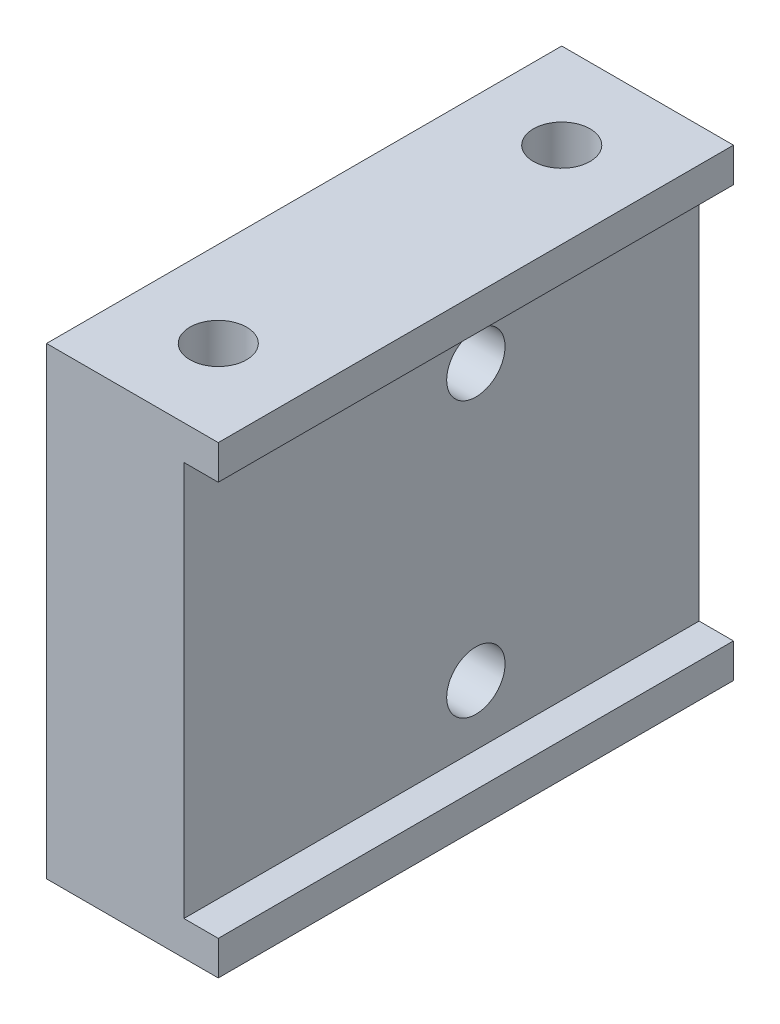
ISO-10303-21;
HEADER;
FILE_DESCRIPTION(('STEP AP214'),'2;1');
FILE_NAME('part.step','',(''),(''),'','','');
FILE_SCHEMA(('AUTOMOTIVE_DESIGN { 1 0 10303 214 1 1 1 1 }'));
ENDSEC;
DATA;
#1=APPLICATION_CONTEXT('core data for automotive mechanical design processes');
#2=APPLICATION_PROTOCOL_DEFINITION('international standard','automotive_design',2000,#1);
#3=PRODUCT_CONTEXT('',#1,'mechanical');
#4=PRODUCT('Part','Part','',(#3));
#5=PRODUCT_RELATED_PRODUCT_CATEGORY('part','',(#4));
#6=PRODUCT_DEFINITION_FORMATION('','',#4);
#7=PRODUCT_DEFINITION_CONTEXT('part definition',#1,'design');
#8=PRODUCT_DEFINITION('design','',#6,#7);
#9=PRODUCT_DEFINITION_SHAPE('','',#8);
#10=(LENGTH_UNIT() NAMED_UNIT(*) SI_UNIT(.MILLI.,.METRE.));
#11=(NAMED_UNIT(*) PLANE_ANGLE_UNIT() SI_UNIT($,.RADIAN.));
#12=(NAMED_UNIT(*) SI_UNIT($,.STERADIAN.) SOLID_ANGLE_UNIT());
#13=UNCERTAINTY_MEASURE_WITH_UNIT(LENGTH_MEASURE(1.E-05),#10,'distance_accuracy_value','');
#14=(GEOMETRIC_REPRESENTATION_CONTEXT(3) GLOBAL_UNCERTAINTY_ASSIGNED_CONTEXT((#13)) GLOBAL_UNIT_ASSIGNED_CONTEXT((#10,
#11,#12)) REPRESENTATION_CONTEXT('',''));
#15=CARTESIAN_POINT('',(0.,0.,0.));
#16=DIRECTION('',(0.,0.,1.));
#17=DIRECTION('',(1.,0.,0.));
#18=AXIS2_PLACEMENT_3D('',#15,#16,#17);
#19=CARTESIAN_POINT('',(24.3,-8.,-30.));
#20=DIRECTION('',(1.,0.,0.));
#21=DIRECTION('',(0.,1.,0.));
#22=AXIS2_PLACEMENT_3D('',#19,#20,#21);
#23=PLANE('',#22);
#24=DIRECTION('',(0.,0.,1.));
#25=VECTOR('',#24,1.);
#26=CARTESIAN_POINT('',(24.3,-33.,-30.));
#27=LINE('',#26,#25);
#28=CARTESIAN_POINT('',(24.3,-33.,-30.));
#29=VERTEX_POINT('',#28);
#30=CARTESIAN_POINT('',(24.3,-33.,0.));
#31=VERTEX_POINT('',#30);
#32=EDGE_CURVE('E151',#29,#31,#27,.T.);
#33=ORIENTED_EDGE('',*,*,#32,.T.);
#34=DIRECTION('',(0.,1.,0.));
#35=VECTOR('',#34,1.);
#36=CARTESIAN_POINT('',(24.3,-8.,0.));
#37=LINE('',#36,#35);
#38=CARTESIAN_POINT('',(24.3,-35.,0.));
#39=VERTEX_POINT('',#38);
#40=EDGE_CURVE('E177',#39,#31,#37,.T.);
#41=ORIENTED_EDGE('',*,*,#40,.F.);
#42=DIRECTION('',(0.,0.,1.));
#43=VECTOR('',#42,1.);
#44=CARTESIAN_POINT('',(24.3,-35.,-30.));
#45=LINE('',#44,#43);
#46=CARTESIAN_POINT('',(24.3,-35.,-30.));
#47=VERTEX_POINT('',#46);
#48=EDGE_CURVE('E184',#47,#39,#45,.T.);
#49=ORIENTED_EDGE('',*,*,#48,.F.);
#50=DIRECTION('',(0.,1.,0.));
#51=VECTOR('',#50,1.);
#52=CARTESIAN_POINT('',(24.3,-8.,-30.));
#53=LINE('',#52,#51);
#54=EDGE_CURVE('E166',#47,#29,#53,.T.);
#55=ORIENTED_EDGE('',*,*,#54,.T.);
#56=EDGE_LOOP('',(#33,#41,#49,#55));
#57=FACE_BOUND('',#56,.T.);
#58=ADVANCED_FACE('F16',(#57),#23,.T.);
#59=CARTESIAN_POINT('',(14.3,-8.,-30.));
#60=DIRECTION('',(-1.,0.,0.));
#61=DIRECTION('',(0.,-1.,0.));
#62=AXIS2_PLACEMENT_3D('',#59,#60,#61);
#63=PLANE('',#62);
#64=CARTESIAN_POINT('',(14.3,-13.5,-17.));
#65=DIRECTION('',(-1.,0.,0.));
#66=DIRECTION('',(0.,0.,1.));
#67=AXIS2_PLACEMENT_3D('',#64,#65,#66);
#68=CIRCLE('',#67,3.);
#69=CARTESIAN_POINT('',(14.3,-13.5,-14.));
#70=VERTEX_POINT('',#69);
#71=EDGE_CURVE('E116',#70,#70,#68,.T.);
#72=ORIENTED_EDGE('',*,*,#71,.F.);
#73=EDGE_LOOP('',(#72));
#74=FACE_BOUND('',#73,.T.);
#75=CARTESIAN_POINT('',(14.3,-29.5,-17.));
#76=DIRECTION('',(-1.,0.,0.));
#77=DIRECTION('',(0.,0.,1.));
#78=AXIS2_PLACEMENT_3D('',#75,#76,#77);
#79=CIRCLE('',#78,3.);
#80=CARTESIAN_POINT('',(14.3,-29.5,-14.));
#81=VERTEX_POINT('',#80);
#82=EDGE_CURVE('E125',#81,#81,#79,.T.);
#83=ORIENTED_EDGE('',*,*,#82,.F.);
#84=EDGE_LOOP('',(#83));
#85=FACE_BOUND('',#84,.T.);
#86=DIRECTION('',(0.,-1.,0.));
#87=VECTOR('',#86,1.);
#88=CARTESIAN_POINT('',(14.3,-8.,0.));
#89=LINE('',#88,#87);
#90=CARTESIAN_POINT('',(14.3,-8.,0.));
#91=VERTEX_POINT('',#90);
#92=CARTESIAN_POINT('',(14.3,-35.,0.));
#93=VERTEX_POINT('',#92);
#94=EDGE_CURVE('E154',#91,#93,#89,.T.);
#95=ORIENTED_EDGE('',*,*,#94,.F.);
#96=DIRECTION('',(0.,0.,1.));
#97=VECTOR('',#96,1.);
#98=CARTESIAN_POINT('',(14.3,-8.,-30.));
#99=LINE('',#98,#97);
#100=CARTESIAN_POINT('',(14.3,-8.,-30.));
#101=VERTEX_POINT('',#100);
#102=EDGE_CURVE('E11',#101,#91,#99,.T.);
#103=ORIENTED_EDGE('',*,*,#102,.F.);
#104=DIRECTION('',(0.,-1.,0.));
#105=VECTOR('',#104,1.);
#106=CARTESIAN_POINT('',(14.3,-8.,-30.));
#107=LINE('',#106,#105);
#108=CARTESIAN_POINT('',(14.3,-35.,-30.));
#109=VERTEX_POINT('',#108);
#110=EDGE_CURVE('E160',#101,#109,#107,.T.);
#111=ORIENTED_EDGE('',*,*,#110,.T.);
#112=DIRECTION('',(0.,0.,1.));
#113=VECTOR('',#112,1.);
#114=CARTESIAN_POINT('',(14.3,-35.,-30.));
#115=LINE('',#114,#113);
#116=EDGE_CURVE('E66',#109,#93,#115,.T.);
#117=ORIENTED_EDGE('',*,*,#116,.T.);
#118=EDGE_LOOP('',(#95,#103,#111,#117));
#119=FACE_BOUND('',#118,.T.);
#120=ADVANCED_FACE('F18',(#74,#85,#119),#63,.T.);
#121=CARTESIAN_POINT('',(14.3,-8.,-30.));
#122=DIRECTION('',(0.,1.,0.));
#123=DIRECTION('',(0.,0.,1.));
#124=AXIS2_PLACEMENT_3D('',#121,#122,#123);
#125=PLANE('',#124);
#126=CARTESIAN_POINT('',(19.3,-8.,-5.));
#127=DIRECTION('',(0.,1.,0.));
#128=DIRECTION('',(0.,0.,1.));
#129=AXIS2_PLACEMENT_3D('',#126,#127,#128);
#130=CIRCLE('',#129,1.65);
#131=CARTESIAN_POINT('',(19.3,-8.,-3.35));
#132=VERTEX_POINT('',#131);
#133=EDGE_CURVE('E106',#132,#132,#130,.T.);
#134=ORIENTED_EDGE('',*,*,#133,.F.);
#135=EDGE_LOOP('',(#134));
#136=FACE_BOUND('',#135,.T.);
#137=CARTESIAN_POINT('',(19.3,-8.,-25.));
#138=DIRECTION('',(0.,1.,0.));
#139=DIRECTION('',(0.,0.,1.));
#140=AXIS2_PLACEMENT_3D('',#137,#138,#139);
#141=CIRCLE('',#140,1.65);
#142=CARTESIAN_POINT('',(19.3,-8.,-23.35));
#143=VERTEX_POINT('',#142);
#144=EDGE_CURVE('E105',#143,#143,#141,.T.);
#145=ORIENTED_EDGE('',*,*,#144,.F.);
#146=EDGE_LOOP('',(#145));
#147=FACE_BOUND('',#146,.T.);
#148=DIRECTION('',(-1.,0.,0.));
#149=VECTOR('',#148,1.);
#150=CARTESIAN_POINT('',(14.3,-8.,0.));
#151=LINE('',#150,#149);
#152=CARTESIAN_POINT('',(24.3,-8.,0.));
#153=VERTEX_POINT('',#152);
#154=EDGE_CURVE('E163',#153,#91,#151,.T.);
#155=ORIENTED_EDGE('',*,*,#154,.F.);
#156=DIRECTION('',(0.,0.,1.));
#157=VECTOR('',#156,1.);
#158=CARTESIAN_POINT('',(24.3,-8.,-30.));
#159=LINE('',#158,#157);
#160=CARTESIAN_POINT('',(24.3,-8.,-30.));
#161=VERTEX_POINT('',#160);
#162=EDGE_CURVE('E25',#161,#153,#159,.T.);
#163=ORIENTED_EDGE('',*,*,#162,.F.);
#164=DIRECTION('',(-1.,0.,0.));
#165=VECTOR('',#164,1.);
#166=CARTESIAN_POINT('',(14.3,-8.,-30.));
#167=LINE('',#166,#165);
#168=EDGE_CURVE('E169',#161,#101,#167,.T.);
#169=ORIENTED_EDGE('',*,*,#168,.T.);
#170=ORIENTED_EDGE('',*,*,#102,.T.);
#171=EDGE_LOOP('',(#155,#163,#169,#170));
#172=FACE_BOUND('',#171,.T.);
#173=ADVANCED_FACE('F217',(#136,#147,#172),#125,.T.);
#174=DIRECTION('',(0.,0.,1.));
#175=VECTOR('',#174,1.);
#176=CARTESIAN_POINT('',(24.3,-10.,-30.));
#177=LINE('',#176,#175);
#178=CARTESIAN_POINT('',(24.3,-10.,-30.));
#179=VERTEX_POINT('',#178);
#180=CARTESIAN_POINT('',(24.3,-10.,0.));
#181=VERTEX_POINT('',#180);
#182=EDGE_CURVE('E33',#179,#181,#177,.T.);
#183=ORIENTED_EDGE('',*,*,#182,.F.);
#184=EDGE_CURVE('E165',#179,#161,#53,.T.);
#185=ORIENTED_EDGE('',*,*,#184,.T.);
#186=ORIENTED_EDGE('',*,*,#162,.T.);
#187=EDGE_CURVE('E176',#181,#153,#37,.T.);
#188=ORIENTED_EDGE('',*,*,#187,.F.);
#189=EDGE_LOOP('',(#183,#185,#186,#188));
#190=FACE_BOUND('',#189,.T.);
#191=ADVANCED_FACE('F212',(#190),#23,.T.);
#192=CARTESIAN_POINT('',(14.3,-35.,-30.));
#193=DIRECTION('',(0.,-1.,0.));
#194=DIRECTION('',(0.,0.,-1.));
#195=AXIS2_PLACEMENT_3D('',#192,#193,#194);
#196=PLANE('',#195);
#197=DIRECTION('',(1.,0.,0.));
#198=VECTOR('',#197,1.);
#199=CARTESIAN_POINT('',(14.3,-35.,0.));
#200=LINE('',#199,#198);
#201=EDGE_CURVE('E173',#93,#39,#200,.T.);
#202=ORIENTED_EDGE('',*,*,#201,.F.);
#203=ORIENTED_EDGE('',*,*,#116,.F.);
#204=DIRECTION('',(1.,0.,0.));
#205=VECTOR('',#204,1.);
#206=CARTESIAN_POINT('',(14.3,-35.,-30.));
#207=LINE('',#206,#205);
#208=EDGE_CURVE('E162',#109,#47,#207,.T.);
#209=ORIENTED_EDGE('',*,*,#208,.T.);
#210=ORIENTED_EDGE('',*,*,#48,.T.);
#211=EDGE_LOOP('',(#202,#203,#209,#210));
#212=FACE_BOUND('',#211,.T.);
#213=ADVANCED_FACE('F221',(#212),#196,.T.);
#214=CARTESIAN_POINT('',(0.,0.,-30.));
#215=DIRECTION('',(0.,0.,1.));
#216=DIRECTION('',(1.,0.,0.));
#217=AXIS2_PLACEMENT_3D('',#214,#215,#216);
#218=PLANE('',#217);
#219=DIRECTION('',(0.,-1.,0.));
#220=VECTOR('',#219,1.);
#221=CARTESIAN_POINT('',(22.3,-33.,-30.));
#222=LINE('',#221,#220);
#223=CARTESIAN_POINT('',(22.3,-10.,-30.));
#224=VERTEX_POINT('',#223);
#225=CARTESIAN_POINT('',(22.3,-33.,-30.));
#226=VERTEX_POINT('',#225);
#227=EDGE_CURVE('E138',#224,#226,#222,.T.);
#228=ORIENTED_EDGE('',*,*,#227,.T.);
#229=DIRECTION('',(1.,0.,0.));
#230=VECTOR('',#229,1.);
#231=CARTESIAN_POINT('',(24.3,-33.,-30.));
#232=LINE('',#231,#230);
#233=EDGE_CURVE('E142',#226,#29,#232,.T.);
#234=ORIENTED_EDGE('',*,*,#233,.T.);
#235=ORIENTED_EDGE('',*,*,#54,.F.);
#236=ORIENTED_EDGE('',*,*,#208,.F.);
#237=ORIENTED_EDGE('',*,*,#110,.F.);
#238=ORIENTED_EDGE('',*,*,#168,.F.);
#239=ORIENTED_EDGE('',*,*,#184,.F.);
#240=DIRECTION('',(-1.,0.,0.));
#241=VECTOR('',#240,1.);
#242=CARTESIAN_POINT('',(24.3,-10.,-30.));
#243=LINE('',#242,#241);
#244=EDGE_CURVE('E135',#179,#224,#243,.T.);
#245=ORIENTED_EDGE('',*,*,#244,.T.);
#246=EDGE_LOOP('',(#228,#234,#235,#236,#237,#238,#239,#245));
#247=FACE_BOUND('',#246,.T.);
#248=ADVANCED_FACE('F228',(#247),#218,.F.);
#249=CARTESIAN_POINT('',(0.,0.,0.));
#250=DIRECTION('',(0.,0.,1.));
#251=DIRECTION('',(1.,0.,0.));
#252=AXIS2_PLACEMENT_3D('',#249,#250,#251);
#253=PLANE('',#252);
#254=DIRECTION('',(1.,0.,0.));
#255=VECTOR('',#254,1.);
#256=CARTESIAN_POINT('',(24.3,-33.,0.));
#257=LINE('',#256,#255);
#258=CARTESIAN_POINT('',(22.3,-33.,0.));
#259=VERTEX_POINT('',#258);
#260=EDGE_CURVE('E139',#259,#31,#257,.T.);
#261=ORIENTED_EDGE('',*,*,#260,.F.);
#262=DIRECTION('',(0.,-1.,0.));
#263=VECTOR('',#262,1.);
#264=CARTESIAN_POINT('',(22.3,-33.,0.));
#265=LINE('',#264,#263);
#266=CARTESIAN_POINT('',(22.3,-10.,0.));
#267=VERTEX_POINT('',#266);
#268=EDGE_CURVE('E147',#267,#259,#265,.T.);
#269=ORIENTED_EDGE('',*,*,#268,.F.);
#270=DIRECTION('',(-1.,0.,0.));
#271=VECTOR('',#270,1.);
#272=CARTESIAN_POINT('',(24.3,-10.,0.));
#273=LINE('',#272,#271);
#274=EDGE_CURVE('E145',#181,#267,#273,.T.);
#275=ORIENTED_EDGE('',*,*,#274,.F.);
#276=ORIENTED_EDGE('',*,*,#187,.T.);
#277=ORIENTED_EDGE('',*,*,#154,.T.);
#278=ORIENTED_EDGE('',*,*,#94,.T.);
#279=ORIENTED_EDGE('',*,*,#201,.T.);
#280=ORIENTED_EDGE('',*,*,#40,.T.);
#281=EDGE_LOOP('',(#261,#269,#275,#276,#277,#278,#279,#280));
#282=FACE_BOUND('',#281,.T.);
#283=ADVANCED_FACE('F237',(#282),#253,.T.);
#284=CARTESIAN_POINT('',(24.3,-33.,-30.));
#285=DIRECTION('',(0.,-1.,0.));
#286=DIRECTION('',(0.,0.,-1.));
#287=AXIS2_PLACEMENT_3D('',#284,#285,#286);
#288=PLANE('',#287);
#289=ORIENTED_EDGE('',*,*,#260,.T.);
#290=ORIENTED_EDGE('',*,*,#32,.F.);
#291=ORIENTED_EDGE('',*,*,#233,.F.);
#292=DIRECTION('',(0.,0.,1.));
#293=VECTOR('',#292,1.);
#294=CARTESIAN_POINT('',(22.3,-33.,-30.));
#295=LINE('',#294,#293);
#296=EDGE_CURVE('E155',#226,#259,#295,.T.);
#297=ORIENTED_EDGE('',*,*,#296,.T.);
#298=EDGE_LOOP('',(#289,#290,#291,#297));
#299=FACE_BOUND('',#298,.T.);
#300=ADVANCED_FACE('F244',(#299),#288,.F.);
#301=CARTESIAN_POINT('',(22.3,-33.,-30.));
#302=DIRECTION('',(-1.,0.,0.));
#303=DIRECTION('',(0.,-1.,0.));
#304=AXIS2_PLACEMENT_3D('',#301,#302,#303);
#305=PLANE('',#304);
#306=CARTESIAN_POINT('',(22.3,-13.5,-17.));
#307=DIRECTION('',(-1.,0.,0.));
#308=DIRECTION('',(0.,-1.,0.));
#309=AXIS2_PLACEMENT_3D('',#306,#307,#308);
#310=CIRCLE('',#309,1.7);
#311=CARTESIAN_POINT('',(22.3,-15.2,-17.));
#312=VERTEX_POINT('',#311);
#313=EDGE_CURVE('E20',#312,#312,#310,.T.);
#314=ORIENTED_EDGE('',*,*,#313,.T.);
#315=EDGE_LOOP('',(#314));
#316=FACE_BOUND('',#315,.T.);
#317=CARTESIAN_POINT('',(22.3,-29.5,-17.));
#318=DIRECTION('',(-1.,0.,0.));
#319=DIRECTION('',(0.,-1.,0.));
#320=AXIS2_PLACEMENT_3D('',#317,#318,#319);
#321=CIRCLE('',#320,1.7);
#322=CARTESIAN_POINT('',(22.3,-31.2,-17.));
#323=VERTEX_POINT('',#322);
#324=EDGE_CURVE('E134',#323,#323,#321,.T.);
#325=ORIENTED_EDGE('',*,*,#324,.T.);
#326=EDGE_LOOP('',(#325));
#327=FACE_BOUND('',#326,.T.);
#328=ORIENTED_EDGE('',*,*,#268,.T.);
#329=ORIENTED_EDGE('',*,*,#296,.F.);
#330=ORIENTED_EDGE('',*,*,#227,.F.);
#331=DIRECTION('',(0.,0.,1.));
#332=VECTOR('',#331,1.);
#333=CARTESIAN_POINT('',(22.3,-10.,-30.));
#334=LINE('',#333,#332);
#335=EDGE_CURVE('E157',#224,#267,#334,.T.);
#336=ORIENTED_EDGE('',*,*,#335,.T.);
#337=EDGE_LOOP('',(#328,#329,#330,#336));
#338=FACE_BOUND('',#337,.T.);
#339=ADVANCED_FACE('F189',(#316,#327,#338),#305,.F.);
#340=CARTESIAN_POINT('',(24.3,-10.,-30.));
#341=DIRECTION('',(0.,1.,0.));
#342=DIRECTION('',(0.,0.,1.));
#343=AXIS2_PLACEMENT_3D('',#340,#341,#342);
#344=PLANE('',#343);
#345=ORIENTED_EDGE('',*,*,#274,.T.);
#346=ORIENTED_EDGE('',*,*,#335,.F.);
#347=ORIENTED_EDGE('',*,*,#244,.F.);
#348=ORIENTED_EDGE('',*,*,#182,.T.);
#349=EDGE_LOOP('',(#345,#346,#347,#348));
#350=FACE_BOUND('',#349,.T.);
#351=ADVANCED_FACE('F195',(#350),#344,.F.);
#352=CARTESIAN_POINT('',(14.3,-29.5,-17.));
#353=DIRECTION('',(-1.,0.,0.));
#354=DIRECTION('',(0.,0.,1.));
#355=AXIS2_PLACEMENT_3D('',#352,#353,#354);
#356=CYLINDRICAL_SURFACE('',#355,1.7);
#357=CARTESIAN_POINT('',(17.7,-29.5,-17.));
#358=DIRECTION('',(-1.,0.,0.));
#359=DIRECTION('',(0.,0.,1.));
#360=AXIS2_PLACEMENT_3D('',#357,#358,#359);
#361=CIRCLE('',#360,1.7);
#362=CARTESIAN_POINT('',(17.7,-29.5,-15.3));
#363=VERTEX_POINT('',#362);
#364=EDGE_CURVE('E131',#363,#363,#361,.T.);
#365=ORIENTED_EDGE('',*,*,#364,.T.);
#366=EDGE_LOOP('',(#365));
#367=FACE_BOUND('',#366,.T.);
#368=ORIENTED_EDGE('',*,*,#324,.F.);
#369=EDGE_LOOP('',(#368));
#370=FACE_BOUND('',#369,.T.);
#371=ADVANCED_FACE('F192',(#367,#370),#356,.F.);
#372=CARTESIAN_POINT('',(17.7,-27.8,-17.));
#373=DIRECTION('',(1.,0.,0.));
#374=DIRECTION('',(0.,0.,-1.));
#375=AXIS2_PLACEMENT_3D('',#372,#373,#374);
#376=PLANE('',#375);
#377=ORIENTED_EDGE('',*,*,#364,.F.);
#378=EDGE_LOOP('',(#377));
#379=FACE_BOUND('',#378,.T.);
#380=CARTESIAN_POINT('',(17.7,-29.5,-17.));
#381=DIRECTION('',(-1.,0.,0.));
#382=DIRECTION('',(0.,0.,1.));
#383=AXIS2_PLACEMENT_3D('',#380,#381,#382);
#384=CIRCLE('',#383,3.);
#385=CARTESIAN_POINT('',(17.7,-29.5,-14.));
#386=VERTEX_POINT('',#385);
#387=EDGE_CURVE('E128',#386,#386,#384,.T.);
#388=ORIENTED_EDGE('',*,*,#387,.T.);
#389=EDGE_LOOP('',(#388));
#390=FACE_BOUND('',#389,.T.);
#391=ADVANCED_FACE('F194',(#379,#390),#376,.F.);
#392=CARTESIAN_POINT('',(14.3,-29.5,-17.));
#393=DIRECTION('',(-1.,0.,0.));
#394=DIRECTION('',(0.,0.,1.));
#395=AXIS2_PLACEMENT_3D('',#392,#393,#394);
#396=CYLINDRICAL_SURFACE('',#395,3.);
#397=ORIENTED_EDGE('',*,*,#387,.F.);
#398=EDGE_LOOP('',(#397));
#399=FACE_BOUND('',#398,.T.);
#400=ORIENTED_EDGE('',*,*,#82,.T.);
#401=EDGE_LOOP('',(#400));
#402=FACE_BOUND('',#401,.T.);
#403=ADVANCED_FACE('F204',(#399,#402),#396,.F.);
#404=CARTESIAN_POINT('',(14.3,-13.5,-17.));
#405=DIRECTION('',(-1.,0.,0.));
#406=DIRECTION('',(0.,0.,1.));
#407=AXIS2_PLACEMENT_3D('',#404,#405,#406);
#408=CYLINDRICAL_SURFACE('',#407,1.7);
#409=CARTESIAN_POINT('',(17.7,-13.5,-17.));
#410=DIRECTION('',(-1.,0.,0.));
#411=DIRECTION('',(0.,0.,1.));
#412=AXIS2_PLACEMENT_3D('',#409,#410,#411);
#413=CIRCLE('',#412,1.7);
#414=CARTESIAN_POINT('',(17.7,-13.5,-15.3));
#415=VERTEX_POINT('',#414);
#416=EDGE_CURVE('E122',#415,#415,#413,.T.);
#417=ORIENTED_EDGE('',*,*,#416,.T.);
#418=EDGE_LOOP('',(#417));
#419=FACE_BOUND('',#418,.T.);
#420=ORIENTED_EDGE('',*,*,#313,.F.);
#421=EDGE_LOOP('',(#420));
#422=FACE_BOUND('',#421,.T.);
#423=ADVANCED_FACE('F307',(#419,#422),#408,.F.);
#424=CARTESIAN_POINT('',(17.7,-11.8,-17.));
#425=DIRECTION('',(1.,0.,0.));
#426=DIRECTION('',(0.,0.,-1.));
#427=AXIS2_PLACEMENT_3D('',#424,#425,#426);
#428=PLANE('',#427);
#429=ORIENTED_EDGE('',*,*,#416,.F.);
#430=EDGE_LOOP('',(#429));
#431=FACE_BOUND('',#430,.T.);
#432=CARTESIAN_POINT('',(17.7,-13.5,-17.));
#433=DIRECTION('',(-1.,0.,0.));
#434=DIRECTION('',(0.,0.,1.));
#435=AXIS2_PLACEMENT_3D('',#432,#433,#434);
#436=CIRCLE('',#435,3.);
#437=CARTESIAN_POINT('',(17.7,-13.5,-14.));
#438=VERTEX_POINT('',#437);
#439=EDGE_CURVE('E119',#438,#438,#436,.T.);
#440=ORIENTED_EDGE('',*,*,#439,.T.);
#441=EDGE_LOOP('',(#440));
#442=FACE_BOUND('',#441,.T.);
#443=ADVANCED_FACE('F319',(#431,#442),#428,.F.);
#444=CARTESIAN_POINT('',(14.3,-13.5,-17.));
#445=DIRECTION('',(-1.,0.,0.));
#446=DIRECTION('',(0.,0.,1.));
#447=AXIS2_PLACEMENT_3D('',#444,#445,#446);
#448=CYLINDRICAL_SURFACE('',#447,3.);
#449=ORIENTED_EDGE('',*,*,#439,.F.);
#450=EDGE_LOOP('',(#449));
#451=FACE_BOUND('',#450,.T.);
#452=ORIENTED_EDGE('',*,*,#71,.T.);
#453=EDGE_LOOP('',(#452));
#454=FACE_BOUND('',#453,.T.);
#455=ADVANCED_FACE('F329',(#451,#454),#448,.F.);
#456=CARTESIAN_POINT('',(19.3,-23.5,-25.));
#457=DIRECTION('',(0.,1.,0.));
#458=DIRECTION('',(0.,0.,1.));
#459=AXIS2_PLACEMENT_3D('',#456,#457,#458);
#460=CONICAL_SURFACE('',#459,1.65,1.02974425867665);
#461=CARTESIAN_POINT('',(19.3,-24.4914200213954,-25.));
#462=VERTEX_POINT('',#461);
#463=VERTEX_LOOP('',#462);
#464=FACE_BOUND('',#463,.T.);
#465=CARTESIAN_POINT('',(19.3,-23.5,-25.));
#466=DIRECTION('',(0.,1.,0.));
#467=DIRECTION('',(0.,0.,1.));
#468=AXIS2_PLACEMENT_3D('',#465,#466,#467);
#469=CIRCLE('',#468,1.65);
#470=CARTESIAN_POINT('',(19.3,-23.5,-23.35));
#471=VERTEX_POINT('',#470);
#472=EDGE_CURVE('E109',#471,#471,#469,.T.);
#473=ORIENTED_EDGE('',*,*,#472,.T.);
#474=EDGE_LOOP('',(#473));
#475=FACE_BOUND('',#474,.T.);
#476=ADVANCED_FACE('F338',(#464,#475),#460,.F.);
#477=CARTESIAN_POINT('',(19.3,-8.,-25.));
#478=DIRECTION('',(0.,1.,0.));
#479=DIRECTION('',(0.,0.,1.));
#480=AXIS2_PLACEMENT_3D('',#477,#478,#479);
#481=CYLINDRICAL_SURFACE('',#480,1.65);
#482=ORIENTED_EDGE('',*,*,#472,.F.);
#483=EDGE_LOOP('',(#482));
#484=FACE_BOUND('',#483,.T.);
#485=ORIENTED_EDGE('',*,*,#144,.T.);
#486=EDGE_LOOP('',(#485));
#487=FACE_BOUND('',#486,.T.);
#488=ADVANCED_FACE('F99',(#484,#487),#481,.F.);
#489=CARTESIAN_POINT('',(19.3,-23.5,-5.));
#490=DIRECTION('',(0.,1.,0.));
#491=DIRECTION('',(0.,0.,1.));
#492=AXIS2_PLACEMENT_3D('',#489,#490,#491);
#493=CONICAL_SURFACE('',#492,1.65,1.02974425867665);
#494=CARTESIAN_POINT('',(19.3,-24.4914200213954,-5.));
#495=VERTEX_POINT('',#494);
#496=VERTEX_LOOP('',#495);
#497=FACE_BOUND('',#496,.T.);
#498=CARTESIAN_POINT('',(19.3,-23.5,-5.));
#499=DIRECTION('',(0.,1.,0.));
#500=DIRECTION('',(0.,0.,1.));
#501=AXIS2_PLACEMENT_3D('',#498,#499,#500);
#502=CIRCLE('',#501,1.65);
#503=CARTESIAN_POINT('',(19.3,-23.5,-3.35));
#504=VERTEX_POINT('',#503);
#505=EDGE_CURVE('E103',#504,#504,#502,.T.);
#506=ORIENTED_EDGE('',*,*,#505,.T.);
#507=EDGE_LOOP('',(#506));
#508=FACE_BOUND('',#507,.T.);
#509=ADVANCED_FACE('F95',(#497,#508),#493,.F.);
#510=CARTESIAN_POINT('',(19.3,-8.,-5.));
#511=DIRECTION('',(0.,1.,0.));
#512=DIRECTION('',(0.,0.,1.));
#513=AXIS2_PLACEMENT_3D('',#510,#511,#512);
#514=CYLINDRICAL_SURFACE('',#513,1.65);
#515=ORIENTED_EDGE('',*,*,#505,.F.);
#516=EDGE_LOOP('',(#515));
#517=FACE_BOUND('',#516,.T.);
#518=ORIENTED_EDGE('',*,*,#133,.T.);
#519=EDGE_LOOP('',(#518));
#520=FACE_BOUND('',#519,.T.);
#521=ADVANCED_FACE('F98',(#517,#520),#514,.F.);
#522=CLOSED_SHELL('',(#58,#120,#173,#191,#213,#248,#283,#300,#339,#351,#371,#391,#403,#423,#443,
#455,#476,#488,#509,#521));
#523=MANIFOLD_SOLID_BREP('B1',#522);
#524=ADVANCED_BREP_SHAPE_REPRESENTATION('',(#18,#523),#14);
#525=SHAPE_DEFINITION_REPRESENTATION(#9,#524);
ENDSEC;
END-ISO-10303-21;
